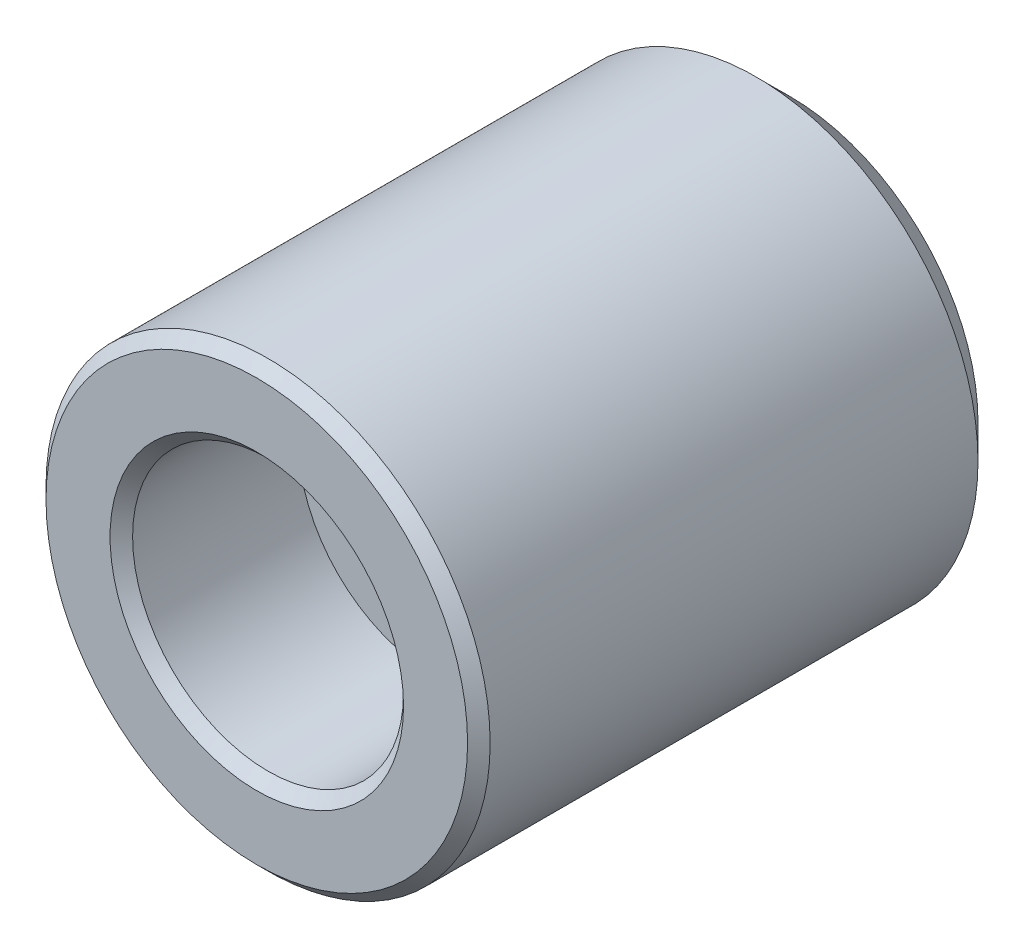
ISO-10303-21;
HEADER;
FILE_DESCRIPTION(('STEP AP214'),'2;1');
FILE_NAME('part.step','',(''),(''),'','','');
FILE_SCHEMA(('AUTOMOTIVE_DESIGN { 1 0 10303 214 1 1 1 1 }'));
ENDSEC;
DATA;
#1=APPLICATION_CONTEXT('core data for automotive mechanical design processes');
#2=APPLICATION_PROTOCOL_DEFINITION('international standard','automotive_design',2000,#1);
#3=PRODUCT_CONTEXT('',#1,'mechanical');
#4=PRODUCT('Part','Part','',(#3));
#5=PRODUCT_RELATED_PRODUCT_CATEGORY('part','',(#4));
#6=PRODUCT_DEFINITION_FORMATION('','',#4);
#7=PRODUCT_DEFINITION_CONTEXT('part definition',#1,'design');
#8=PRODUCT_DEFINITION('design','',#6,#7);
#9=PRODUCT_DEFINITION_SHAPE('','',#8);
#10=(LENGTH_UNIT() NAMED_UNIT(*) SI_UNIT(.MILLI.,.METRE.));
#11=(NAMED_UNIT(*) PLANE_ANGLE_UNIT() SI_UNIT($,.RADIAN.));
#12=(NAMED_UNIT(*) SI_UNIT($,.STERADIAN.) SOLID_ANGLE_UNIT());
#13=UNCERTAINTY_MEASURE_WITH_UNIT(LENGTH_MEASURE(1.E-05),#10,'distance_accuracy_value','');
#14=(GEOMETRIC_REPRESENTATION_CONTEXT(3) GLOBAL_UNCERTAINTY_ASSIGNED_CONTEXT((#13)) GLOBAL_UNIT_ASSIGNED_CONTEXT((#10,
#11,#12)) REPRESENTATION_CONTEXT('',''));
#15=CARTESIAN_POINT('',(0.,0.,0.));
#16=DIRECTION('',(0.,0.,1.));
#17=DIRECTION('',(1.,0.,0.));
#18=AXIS2_PLACEMENT_3D('',#15,#16,#17);
#19=CARTESIAN_POINT('',(0.,0.,12.));
#20=DIRECTION('',(0.,0.,1.));
#21=DIRECTION('',(1.,0.,0.));
#22=AXIS2_PLACEMENT_3D('',#19,#20,#21);
#23=CYLINDRICAL_SURFACE('',#22,1.8668999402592);
#24=CARTESIAN_POINT('',(0.,0.,0.2540000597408));
#25=DIRECTION('',(0.,0.,1.));
#26=DIRECTION('',(1.,0.,0.));
#27=AXIS2_PLACEMENT_3D('',#24,#25,#26);
#28=CIRCLE('',#27,1.8668999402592);
#29=CARTESIAN_POINT('',(1.8668999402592,0.,0.2540000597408));
#30=VERTEX_POINT('',#29);
#31=EDGE_CURVE('E32',#30,#30,#28,.T.);
#32=ORIENTED_EDGE('',*,*,#31,.F.);
#33=EDGE_LOOP('',(#32));
#34=FACE_BOUND('',#33,.T.);
#35=CARTESIAN_POINT('',(0.,0.,8.0122));
#36=DIRECTION('',(0.,0.,1.));
#37=DIRECTION('',(1.,0.,0.));
#38=AXIS2_PLACEMENT_3D('',#35,#36,#37);
#39=CIRCLE('',#38,1.8668999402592);
#40=CARTESIAN_POINT('',(1.8668999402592,0.,8.0122));
#41=VERTEX_POINT('',#40);
#42=EDGE_CURVE('E30',#41,#41,#39,.F.);
#43=ORIENTED_EDGE('',*,*,#42,.F.);
#44=EDGE_LOOP('',(#43));
#45=FACE_BOUND('',#44,.T.);
#46=ADVANCED_FACE('F12',(#34,#45),#23,.F.);
#47=CARTESIAN_POINT('',(0.,0.,0.));
#48=DIRECTION('',(0.,0.,1.));
#49=DIRECTION('',(1.,0.,0.));
#50=AXIS2_PLACEMENT_3D('',#47,#48,#49);
#51=CYLINDRICAL_SURFACE('',#50,5.);
#52=CARTESIAN_POINT('',(0.,0.,0.762));
#53=DIRECTION('',(0.,0.,1.));
#54=DIRECTION('',(1.,0.,0.));
#55=AXIS2_PLACEMENT_3D('',#52,#53,#54);
#56=CIRCLE('',#55,5.);
#57=CARTESIAN_POINT('',(5.,0.,0.762));
#58=VERTEX_POINT('',#57);
#59=EDGE_CURVE('E27',#58,#58,#56,.T.);
#60=ORIENTED_EDGE('',*,*,#59,.T.);
#61=EDGE_LOOP('',(#60));
#62=FACE_BOUND('',#61,.T.);
#63=CARTESIAN_POINT('',(0.,0.,11.746));
#64=DIRECTION('',(0.,0.,1.));
#65=DIRECTION('',(1.,0.,0.));
#66=AXIS2_PLACEMENT_3D('',#63,#64,#65);
#67=CIRCLE('',#66,5.);
#68=CARTESIAN_POINT('',(5.,0.,11.746));
#69=VERTEX_POINT('',#68);
#70=EDGE_CURVE('E37',#69,#69,#67,.F.);
#71=ORIENTED_EDGE('',*,*,#70,.T.);
#72=EDGE_LOOP('',(#71));
#73=FACE_BOUND('',#72,.T.);
#74=ADVANCED_FACE('F68',(#62,#73),#51,.T.);
#75=CARTESIAN_POINT('',(0.,0.,0.));
#76=DIRECTION('',(0.,0.,1.));
#77=DIRECTION('',(1.,0.,0.));
#78=AXIS2_PLACEMENT_3D('',#75,#76,#77);
#79=PLANE('',#78);
#80=CARTESIAN_POINT('',(0.,0.,0.));
#81=DIRECTION('',(0.,0.,1.));
#82=DIRECTION('',(1.,0.,0.));
#83=AXIS2_PLACEMENT_3D('',#80,#81,#82);
#84=CIRCLE('',#83,2.1209);
#85=CARTESIAN_POINT('',(2.1209,0.,0.));
#86=VERTEX_POINT('',#85);
#87=EDGE_CURVE('E43',#86,#86,#84,.T.);
#88=ORIENTED_EDGE('',*,*,#87,.T.);
#89=EDGE_LOOP('',(#88));
#90=FACE_BOUND('',#89,.T.);
#91=CARTESIAN_POINT('',(0.,0.,0.));
#92=DIRECTION('',(0.,0.,1.));
#93=DIRECTION('',(1.,0.,0.));
#94=AXIS2_PLACEMENT_3D('',#91,#92,#93);
#95=CIRCLE('',#94,4.238);
#96=CARTESIAN_POINT('',(4.238,0.,0.));
#97=VERTEX_POINT('',#96);
#98=EDGE_CURVE('E23',#97,#97,#95,.F.);
#99=ORIENTED_EDGE('',*,*,#98,.T.);
#100=EDGE_LOOP('',(#99));
#101=FACE_BOUND('',#100,.T.);
#102=ADVANCED_FACE('F74',(#90,#101),#79,.F.);
#103=CARTESIAN_POINT('',(0.,0.,12.));
#104=DIRECTION('',(0.,0.,1.));
#105=DIRECTION('',(1.,0.,0.));
#106=AXIS2_PLACEMENT_3D('',#103,#104,#105);
#107=PLANE('',#106);
#108=CARTESIAN_POINT('',(0.,0.,12.));
#109=DIRECTION('',(0.,0.,1.));
#110=DIRECTION('',(1.,0.,0.));
#111=AXIS2_PLACEMENT_3D('',#108,#109,#110);
#112=CIRCLE('',#111,3.304);
#113=CARTESIAN_POINT('',(3.304,0.,12.));
#114=VERTEX_POINT('',#113);
#115=EDGE_CURVE('E8',#114,#114,#112,.F.);
#116=ORIENTED_EDGE('',*,*,#115,.T.);
#117=EDGE_LOOP('',(#116));
#118=FACE_BOUND('',#117,.T.);
#119=CARTESIAN_POINT('',(0.,0.,12.));
#120=DIRECTION('',(0.,0.,1.));
#121=DIRECTION('',(1.,0.,0.));
#122=AXIS2_PLACEMENT_3D('',#119,#120,#121);
#123=CIRCLE('',#122,4.746);
#124=CARTESIAN_POINT('',(4.746,0.,12.));
#125=VERTEX_POINT('',#124);
#126=EDGE_CURVE('E40',#125,#125,#123,.T.);
#127=ORIENTED_EDGE('',*,*,#126,.T.);
#128=EDGE_LOOP('',(#127));
#129=FACE_BOUND('',#128,.T.);
#130=ADVANCED_FACE('F86',(#118,#129),#107,.T.);
#131=CARTESIAN_POINT('',(0.,0.,12.));
#132=DIRECTION('',(0.,0.,-1.));
#133=DIRECTION('',(-1.,0.,0.));
#134=AXIS2_PLACEMENT_3D('',#131,#132,#133);
#135=CONICAL_SURFACE('',#134,4.746,0.78539816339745);
#136=ORIENTED_EDGE('',*,*,#70,.F.);
#137=EDGE_LOOP('',(#136));
#138=FACE_BOUND('',#137,.T.);
#139=ORIENTED_EDGE('',*,*,#126,.F.);
#140=EDGE_LOOP('',(#139));
#141=FACE_BOUND('',#140,.T.);
#142=ADVANCED_FACE('F89',(#138,#141),#135,.T.);
#143=CARTESIAN_POINT('',(0.,0.,0.762));
#144=DIRECTION('',(0.,0.,1.));
#145=DIRECTION('',(1.,0.,0.));
#146=AXIS2_PLACEMENT_3D('',#143,#144,#145);
#147=CONICAL_SURFACE('',#146,5.,0.785398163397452);
#148=ORIENTED_EDGE('',*,*,#98,.F.);
#149=EDGE_LOOP('',(#148));
#150=FACE_BOUND('',#149,.T.);
#151=ORIENTED_EDGE('',*,*,#59,.F.);
#152=EDGE_LOOP('',(#151));
#153=FACE_BOUND('',#152,.T.);
#154=ADVANCED_FACE('F82',(#150,#153),#147,.T.);
#155=CARTESIAN_POINT('',(0.,0.,0.2540000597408));
#156=DIRECTION('',(0.,0.,-1.));
#157=DIRECTION('',(-1.,0.,0.));
#158=AXIS2_PLACEMENT_3D('',#155,#156,#157);
#159=CONICAL_SURFACE('',#158,1.8668999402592,0.785398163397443);
#160=ORIENTED_EDGE('',*,*,#87,.F.);
#161=EDGE_LOOP('',(#160));
#162=FACE_BOUND('',#161,.T.);
#163=ORIENTED_EDGE('',*,*,#31,.T.);
#164=EDGE_LOOP('',(#163));
#165=FACE_BOUND('',#164,.T.);
#166=ADVANCED_FACE('F64',(#162,#165),#159,.F.);
#167=CARTESIAN_POINT('',(0.,0.,8.0122));
#168=DIRECTION('',(0.,0.,1.));
#169=DIRECTION('',(1.,0.,0.));
#170=AXIS2_PLACEMENT_3D('',#167,#168,#169);
#171=PLANE('',#170);
#172=CARTESIAN_POINT('',(0.,0.,8.0122));
#173=DIRECTION('',(0.,0.,1.));
#174=DIRECTION('',(1.,0.,0.));
#175=AXIS2_PLACEMENT_3D('',#172,#173,#174);
#176=CIRCLE('',#175,3.05);
#177=CARTESIAN_POINT('',(3.05,0.,8.0122));
#178=VERTEX_POINT('',#177);
#179=EDGE_CURVE('E33',#178,#178,#176,.T.);
#180=ORIENTED_EDGE('',*,*,#179,.T.);
#181=EDGE_LOOP('',(#180));
#182=FACE_BOUND('',#181,.T.);
#183=ORIENTED_EDGE('',*,*,#42,.T.);
#184=EDGE_LOOP('',(#183));
#185=FACE_BOUND('',#184,.T.);
#186=ADVANCED_FACE('F51',(#182,#185),#171,.T.);
#187=CARTESIAN_POINT('',(0.,0.,8.0122));
#188=DIRECTION('',(0.,0.,1.));
#189=DIRECTION('',(1.,0.,0.));
#190=AXIS2_PLACEMENT_3D('',#187,#188,#189);
#191=CYLINDRICAL_SURFACE('',#190,3.05);
#192=CARTESIAN_POINT('',(0.,0.,11.746));
#193=DIRECTION('',(0.,0.,1.));
#194=DIRECTION('',(1.,0.,0.));
#195=AXIS2_PLACEMENT_3D('',#192,#193,#194);
#196=CIRCLE('',#195,3.05);
#197=CARTESIAN_POINT('',(3.05,0.,11.746));
#198=VERTEX_POINT('',#197);
#199=EDGE_CURVE('E19',#198,#198,#196,.T.);
#200=ORIENTED_EDGE('',*,*,#199,.T.);
#201=EDGE_LOOP('',(#200));
#202=FACE_BOUND('',#201,.T.);
#203=ORIENTED_EDGE('',*,*,#179,.F.);
#204=EDGE_LOOP('',(#203));
#205=FACE_BOUND('',#204,.T.);
#206=ADVANCED_FACE('F54',(#202,#205),#191,.F.);
#207=CARTESIAN_POINT('',(0.,0.,11.746));
#208=DIRECTION('',(0.,0.,1.));
#209=DIRECTION('',(1.,0.,0.));
#210=AXIS2_PLACEMENT_3D('',#207,#208,#209);
#211=CONICAL_SURFACE('',#210,3.05,0.785398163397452);
#212=ORIENTED_EDGE('',*,*,#115,.F.);
#213=EDGE_LOOP('',(#212));
#214=FACE_BOUND('',#213,.T.);
#215=ORIENTED_EDGE('',*,*,#199,.F.);
#216=EDGE_LOOP('',(#215));
#217=FACE_BOUND('',#216,.T.);
#218=ADVANCED_FACE('F14',(#214,#217),#211,.F.);
#219=CLOSED_SHELL('',(#46,#74,#102,#130,#142,#154,#166,#186,#206,#218));
#220=MANIFOLD_SOLID_BREP('B1',#219);
#221=ADVANCED_BREP_SHAPE_REPRESENTATION('',(#18,#220),#14);
#222=SHAPE_DEFINITION_REPRESENTATION(#9,#221);
ENDSEC;
END-ISO-10303-21;
